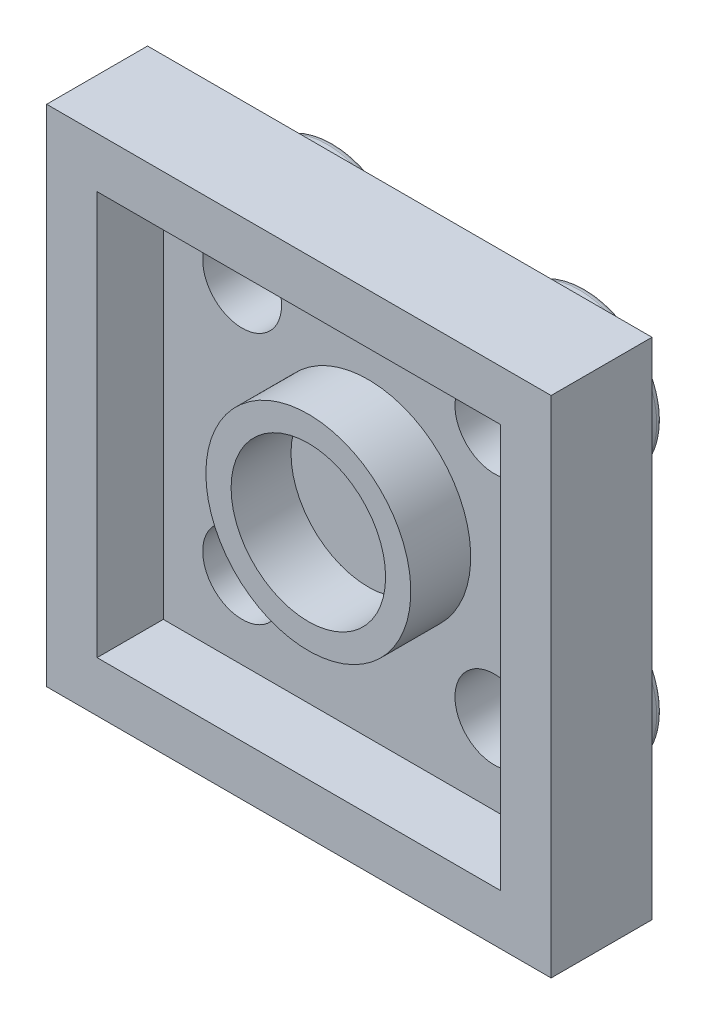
from build123d import *

# Parameters (mm, degrees)
SKIZZE1_W                         = 16
SKIZZE1_H                         = 16
LINEAR_AUSTRAGEN1_DEPTH           = 3.2
SKIZZE2_W                         = 12.8
SKIZZE2_H                         = 12.8
SCHNITT_LINEAR_AUSTRAGEN1_DEPTH   = 2.1
SKIZZE3_R                         = 3.25
SKIZZE3_R_2                       = 2.45
LINEAR_AUSTRAGEN2_DEPTH           = 1.9
SKIZZE4_R                         = 2.45
LINEAR_AUSTRAGEN3_DEPTH           = 1.9
VERRUNDUNG1_R                     = 0.2
SKIZZE9_R                         = 1.25
LINEAR_AUSTRAGEN5_DEPTH           = 1.8
SKIZZE9_2_R                       = 1.25
SCHNITT_LINEAR_AUSTRAGEN3_DEPTH   = 1.8
LINEARES_MUSTER3_COUNT            = 2
LINEARES_MUSTER3_PITCH            = 8
LINEARES_MUSTER3_COUNT_DIR2       = 2
LINEARES_MUSTER3_PITCH_DIR2       = 8
VERRUNDUNG1_OF_LINEARES_MUSTER3_R = 0.2


with BuildPart() as part:
    # Skizze1 → Linear austragen1 (new body)
    with BuildSketch(Plane.XY):
        with Locations((-8, -8)):
            Rectangle(SKIZZE1_W, SKIZZE1_H)
    extrude(amount=LINEAR_AUSTRAGEN1_DEPTH)

    # Skizze2 → Schnitt-Linear austragen1 (cut)
    with BuildSketch(Plane.XY.offset(3.2)):
        with Locations((-8, -8)):
            Rectangle(SKIZZE2_W, SKIZZE2_H)
    extrude(amount=-SCHNITT_LINEAR_AUSTRAGEN1_DEPTH, mode=Mode.SUBTRACT)

    # Skizze3 → Linear austragen2 (add)
    with BuildSketch(Plane.XY.offset(1.1)):
        with Locations(Location((-7.9, -7.80984542, 0), (0, 0, 180))):
            Circle(SKIZZE3_R)
        with Locations(Location((-7.9, -7.80984542, 0), (0, 0, 180))):
            Circle(SKIZZE3_R_2, mode=Mode.SUBTRACT)
    extrude(amount=LINEAR_AUSTRAGEN2_DEPTH)

    # Skizze4 → Linear austragen3 (add)
    with BuildSketch(Plane(origin=(0, 0, 0), x_dir=(-1, 0, 0), z_dir=(0, 0, -1))):
        with Locations(Location((4, -4, 0), (0, 0, 180))):
            Circle(SKIZZE4_R)
    linear_austragen3 = extrude(amount=LINEAR_AUSTRAGEN3_DEPTH)

    # Verrundung1
    verrundung1_edges = [part.edges().sort_by_distance(p)[0] for p in [
        (-6.45, -4, -1.9),
    ]]
    fillet(verrundung1_edges, radius=VERRUNDUNG1_R)

    # Skizze9 → Linear austragen5 (add)
    with BuildSketch(Plane.XY.offset(1.1)):
        with Locations((-3.9, -3.9)):
            Circle(SKIZZE9_R)
    linear_austragen5 = extrude(amount=-LINEAR_AUSTRAGEN5_DEPTH)

    # Skizze9_2 → Schnitt-Linear austragen3 (cut)
    with BuildSketch(Plane.XY.offset(1.1)):
        with Locations((-3.9, -3.9)):
            Circle(SKIZZE9_2_R)
    schnitt_linear_austragen3 = extrude(amount=-SCHNITT_LINEAR_AUSTRAGEN3_DEPTH, mode=Mode.SUBTRACT)

    # Lineares Muster3: Linear austragen3, Linear austragen5, Schnitt-Linear austragen3 2 × 2
    with Locations(*[(-j * LINEARES_MUSTER3_PITCH_DIR2, -i * LINEARES_MUSTER3_PITCH, 0) for i in range(LINEARES_MUSTER3_COUNT) for j in range(LINEARES_MUSTER3_COUNT_DIR2) if (i, j) != (0, 0)]):
        add(linear_austragen3)
        add(linear_austragen5)
        add(schnitt_linear_austragen3, mode=Mode.SUBTRACT)

    # Verrundung1 of Lineares Muster3
    verrundung1_of_lineares_muster3_edges = [part.edges().sort_by_distance(p)[0] for p in [
        (-14.45, -4, -1.9),
        (-6.45, -12, -1.9),
        (-14.45, -12, -1.9),
    ]]
    fillet(verrundung1_of_lineares_muster3_edges, radius=VERRUNDUNG1_OF_LINEARES_MUSTER3_R)


solid = part.part
